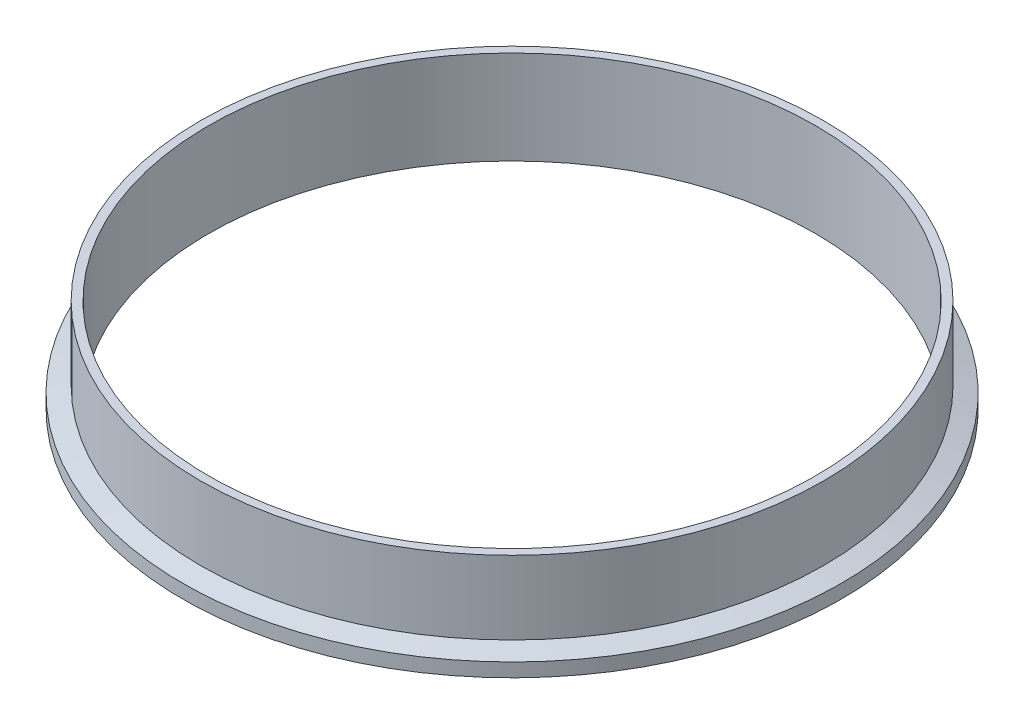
from build123d import *


with BuildPart() as part:
    # Sketch1 → Revolve2 (revolve)
    with BuildSketch(Plane.XY, mode=Mode.PRIVATE) as revolve2_sk:
        with BuildLine():
            Line((-123.5964, 0), (-123.5964, 38.1))
            Line((-123.5964, 38.1), (-127, 38.1))
            Line((-127, 38.1), (-127, 8.222780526))
            Line((-127, 8.222780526), (-134.239, 5.588))
            Line((-134.239, 5.588), (-134.239, 0))
            Line((-134.239, 0), (-130.799208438, 0))
            ThreePointArc((-130.799208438, 0), (-130.367011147, 0.129217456), (-130.076666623, 0.474458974))
            ThreePointArc((-130.076666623, 0.474458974), (-128.9812, 1.1938), (-127.885733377, 0.474458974))
            ThreePointArc((-127.885733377, 0.474458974), (-127.595388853, 0.129217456), (-127.163191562, 0))
            Line((-127.163191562, 0), (-123.5964, 0))
        make_face()
    revolve(revolve2_sk.sketch.rotate(Axis((0, 0, 0), (0, 1, 0)), 270), axis=Axis((0, 0, 0), (0, 1, 0)))


solid = part.part
